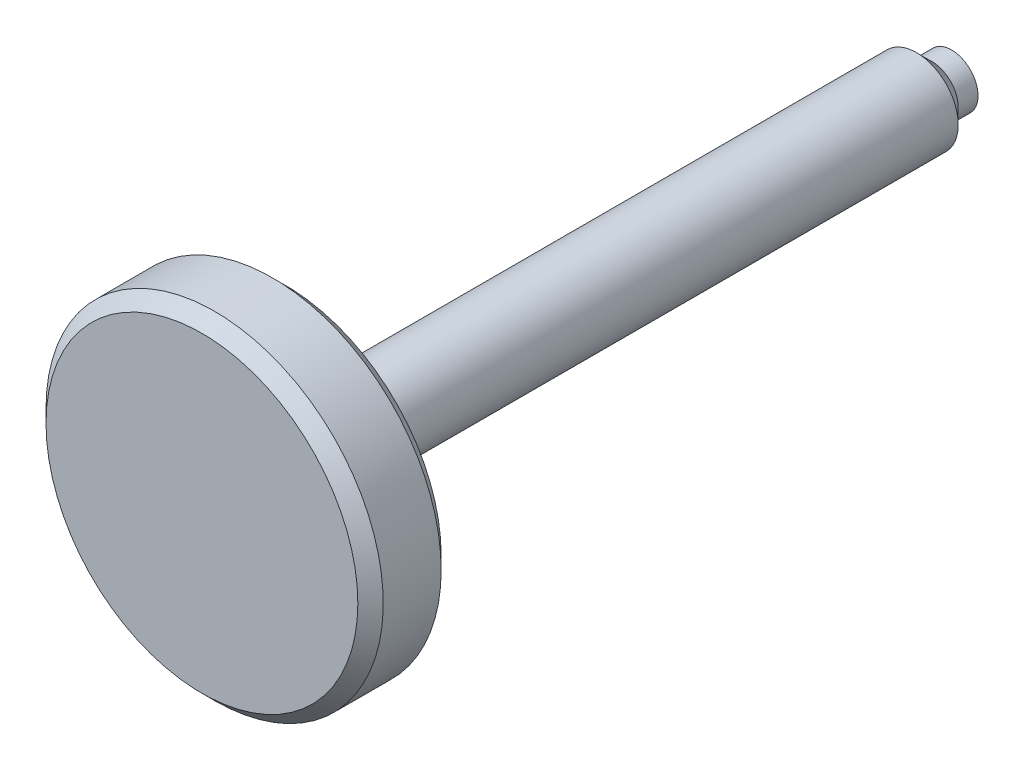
ISO-10303-21;
HEADER;
FILE_DESCRIPTION(('STEP AP214'),'2;1');
FILE_NAME('part.step','',(''),(''),'','','');
FILE_SCHEMA(('AUTOMOTIVE_DESIGN { 1 0 10303 214 1 1 1 1 }'));
ENDSEC;
DATA;
#1=APPLICATION_CONTEXT('core data for automotive mechanical design processes');
#2=APPLICATION_PROTOCOL_DEFINITION('international standard','automotive_design',2000,#1);
#3=PRODUCT_CONTEXT('',#1,'mechanical');
#4=PRODUCT('Part','Part','',(#3));
#5=PRODUCT_RELATED_PRODUCT_CATEGORY('part','',(#4));
#6=PRODUCT_DEFINITION_FORMATION('','',#4);
#7=PRODUCT_DEFINITION_CONTEXT('part definition',#1,'design');
#8=PRODUCT_DEFINITION('design','',#6,#7);
#9=PRODUCT_DEFINITION_SHAPE('','',#8);
#10=(LENGTH_UNIT() NAMED_UNIT(*) SI_UNIT(.MILLI.,.METRE.));
#11=(NAMED_UNIT(*) PLANE_ANGLE_UNIT() SI_UNIT($,.RADIAN.));
#12=(NAMED_UNIT(*) SI_UNIT($,.STERADIAN.) SOLID_ANGLE_UNIT());
#13=UNCERTAINTY_MEASURE_WITH_UNIT(LENGTH_MEASURE(1.E-05),#10,'distance_accuracy_value','');
#14=(GEOMETRIC_REPRESENTATION_CONTEXT(3) GLOBAL_UNCERTAINTY_ASSIGNED_CONTEXT((#13)) GLOBAL_UNIT_ASSIGNED_CONTEXT((#10,
#11,#12)) REPRESENTATION_CONTEXT('',''));
#15=CARTESIAN_POINT('',(0.,0.,0.));
#16=DIRECTION('',(0.,0.,1.));
#17=DIRECTION('',(1.,0.,0.));
#18=AXIS2_PLACEMENT_3D('',#15,#16,#17);
#19=CARTESIAN_POINT('',(9.4722188,-9.4722188,0.));
#20=DIRECTION('',(0.,0.,1.));
#21=DIRECTION('',(1.,0.,0.));
#22=AXIS2_PLACEMENT_3D('',#19,#20,#21);
#23=PLANE('',#22);
#24=CARTESIAN_POINT('',(0.,0.,0.));
#25=DIRECTION('',(0.,0.,1.));
#26=DIRECTION('',(1.,0.,0.));
#27=AXIS2_PLACEMENT_3D('',#24,#25,#26);
#28=CIRCLE('',#27,9.3599);
#29=CARTESIAN_POINT('',(9.3599,0.,0.));
#30=VERTEX_POINT('',#29);
#31=EDGE_CURVE('E35',#30,#30,#28,.T.);
#32=ORIENTED_EDGE('',*,*,#31,.F.);
#33=EDGE_LOOP('',(#32));
#34=FACE_BOUND('',#33,.T.);
#35=CARTESIAN_POINT('',(0.,0.,0.));
#36=DIRECTION('',(0.,0.,-1.));
#37=DIRECTION('',(-1.,0.,0.));
#38=AXIS2_PLACEMENT_3D('',#35,#36,#37);
#39=CIRCLE('',#38,2.5);
#40=CARTESIAN_POINT('',(-2.5,0.,0.));
#41=VERTEX_POINT('',#40);
#42=EDGE_CURVE('E43',#41,#41,#39,.T.);
#43=ORIENTED_EDGE('',*,*,#42,.F.);
#44=EDGE_LOOP('',(#43));
#45=FACE_BOUND('',#44,.T.);
#46=ADVANCED_FACE('F12',(#34,#45),#23,.F.);
#47=CARTESIAN_POINT('',(0.,0.,0.762));
#48=DIRECTION('',(0.,0.,1.));
#49=DIRECTION('',(1.,0.,0.));
#50=AXIS2_PLACEMENT_3D('',#47,#48,#49);
#51=CONICAL_SURFACE('',#50,10.1219,0.785398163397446);
#52=ORIENTED_EDGE('',*,*,#31,.T.);
#53=EDGE_LOOP('',(#52));
#54=FACE_BOUND('',#53,.T.);
#55=CARTESIAN_POINT('',(0.,0.,0.762));
#56=DIRECTION('',(0.,0.,-1.));
#57=DIRECTION('',(-1.,0.,0.));
#58=AXIS2_PLACEMENT_3D('',#55,#56,#57);
#59=CIRCLE('',#58,10.1219);
#60=CARTESIAN_POINT('',(-10.1219,0.,0.762));
#61=VERTEX_POINT('',#60);
#62=EDGE_CURVE('E25',#61,#61,#59,.F.);
#63=ORIENTED_EDGE('',*,*,#62,.F.);
#64=EDGE_LOOP('',(#63));
#65=FACE_BOUND('',#64,.T.);
#66=ADVANCED_FACE('F55',(#54,#65),#51,.T.);
#67=CARTESIAN_POINT('',(9.4722188,9.4722188,5.00126));
#68=DIRECTION('',(0.,0.,-1.));
#69=DIRECTION('',(-1.,0.,0.));
#70=AXIS2_PLACEMENT_3D('',#67,#68,#69);
#71=PLANE('',#70);
#72=CARTESIAN_POINT('',(0.,0.,5.00126));
#73=DIRECTION('',(0.,0.,-1.));
#74=DIRECTION('',(-1.,0.,0.));
#75=AXIS2_PLACEMENT_3D('',#72,#73,#74);
#76=CIRCLE('',#75,9.3599);
#77=CARTESIAN_POINT('',(-9.3599,0.,5.00126));
#78=VERTEX_POINT('',#77);
#79=EDGE_CURVE('E20',#78,#78,#76,.T.);
#80=ORIENTED_EDGE('',*,*,#79,.F.);
#81=EDGE_LOOP('',(#80));
#82=FACE_BOUND('',#81,.T.);
#83=ADVANCED_FACE('F57',(#82),#71,.F.);
#84=CARTESIAN_POINT('',(0.,0.,0.762));
#85=DIRECTION('',(0.,0.,-1.));
#86=DIRECTION('',(-1.,0.,0.));
#87=AXIS2_PLACEMENT_3D('',#84,#85,#86);
#88=CYLINDRICAL_SURFACE('',#87,10.1219);
#89=CARTESIAN_POINT('',(0.,0.,4.23926000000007));
#90=DIRECTION('',(0.,0.,-1.));
#91=DIRECTION('',(0.,-1.,0.));
#92=AXIS2_PLACEMENT_3D('',#89,#90,#91);
#93=CIRCLE('',#92,10.1219);
#94=CARTESIAN_POINT('',(0.,-10.1219,4.23926));
#95=VERTEX_POINT('',#94);
#96=EDGE_CURVE('E8',#95,#95,#93,.F.);
#97=ORIENTED_EDGE('',*,*,#96,.F.);
#98=EDGE_LOOP('',(#97));
#99=FACE_BOUND('',#98,.T.);
#100=ORIENTED_EDGE('',*,*,#62,.T.);
#101=EDGE_LOOP('',(#100));
#102=FACE_BOUND('',#101,.T.);
#103=ADVANCED_FACE('F53',(#99,#102),#88,.T.);
#104=CARTESIAN_POINT('',(0.,0.,4.23926));
#105=DIRECTION('',(0.,0.,-1.));
#106=DIRECTION('',(-1.,0.,0.));
#107=AXIS2_PLACEMENT_3D('',#104,#105,#106);
#108=CONICAL_SURFACE('',#107,10.1219,0.785398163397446);
#109=ORIENTED_EDGE('',*,*,#79,.T.);
#110=EDGE_LOOP('',(#109));
#111=FACE_BOUND('',#110,.T.);
#112=ORIENTED_EDGE('',*,*,#96,.T.);
#113=EDGE_LOOP('',(#112));
#114=FACE_BOUND('',#113,.T.);
#115=ADVANCED_FACE('F14',(#111,#114),#108,.T.);
#116=CARTESIAN_POINT('',(0.,0.,-39.99992));
#117=DIRECTION('',(0.,0.,1.));
#118=DIRECTION('',(1.,0.,0.));
#119=AXIS2_PLACEMENT_3D('',#116,#117,#118);
#120=CYLINDRICAL_SURFACE('',#119,2.5);
#121=CARTESIAN_POINT('',(0.,0.,-37.89616));
#122=DIRECTION('',(0.,0.,1.));
#123=DIRECTION('',(1.,0.,0.));
#124=AXIS2_PLACEMENT_3D('',#121,#122,#123);
#125=CIRCLE('',#124,2.5);
#126=CARTESIAN_POINT('',(2.5,0.,-37.89616));
#127=VERTEX_POINT('',#126);
#128=EDGE_CURVE('E16',#127,#127,#125,.T.);
#129=ORIENTED_EDGE('',*,*,#128,.T.);
#130=EDGE_LOOP('',(#129));
#131=FACE_BOUND('',#130,.T.);
#132=ORIENTED_EDGE('',*,*,#42,.T.);
#133=EDGE_LOOP('',(#132));
#134=FACE_BOUND('',#133,.T.);
#135=ADVANCED_FACE('F69',(#131,#134),#120,.T.);
#136=CARTESIAN_POINT('',(1.60655,-1.60655,-39.99992));
#137=DIRECTION('',(0.,0.,1.));
#138=DIRECTION('',(1.,0.,0.));
#139=AXIS2_PLACEMENT_3D('',#136,#137,#138);
#140=PLANE('',#139);
#141=CARTESIAN_POINT('',(0.,0.,-39.99992));
#142=DIRECTION('',(0.,0.,-1.));
#143=DIRECTION('',(-1.,0.,0.));
#144=AXIS2_PLACEMENT_3D('',#141,#142,#143);
#145=CIRCLE('',#144,1.5875);
#146=CARTESIAN_POINT('',(-1.5875,0.,-39.99992));
#147=VERTEX_POINT('',#146);
#148=EDGE_CURVE('E36',#147,#147,#145,.F.);
#149=ORIENTED_EDGE('',*,*,#148,.F.);
#150=EDGE_LOOP('',(#149));
#151=FACE_BOUND('',#150,.T.);
#152=ADVANCED_FACE('F76',(#151),#140,.F.);
#153=CARTESIAN_POINT('',(0.,0.,-39.99992));
#154=DIRECTION('',(0.,0.,-1.));
#155=DIRECTION('',(-1.,0.,0.));
#156=AXIS2_PLACEMENT_3D('',#153,#154,#155);
#157=CYLINDRICAL_SURFACE('',#156,1.5875);
#158=ORIENTED_EDGE('',*,*,#148,.T.);
#159=EDGE_LOOP('',(#158));
#160=FACE_BOUND('',#159,.T.);
#161=CARTESIAN_POINT('',(0.,0.,-38.80866));
#162=DIRECTION('',(0.,0.,1.));
#163=DIRECTION('',(1.,0.,0.));
#164=AXIS2_PLACEMENT_3D('',#161,#162,#163);
#165=CIRCLE('',#164,1.5875);
#166=CARTESIAN_POINT('',(1.5875,0.,-38.8086600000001));
#167=VERTEX_POINT('',#166);
#168=EDGE_CURVE('E33',#167,#167,#165,.T.);
#169=ORIENTED_EDGE('',*,*,#168,.F.);
#170=EDGE_LOOP('',(#169));
#171=FACE_BOUND('',#170,.T.);
#172=ADVANCED_FACE('F120',(#160,#171),#157,.T.);
#173=CARTESIAN_POINT('',(0.,0.,-37.89553));
#174=DIRECTION('',(0.,0.,1.));
#175=DIRECTION('',(1.,0.,0.));
#176=AXIS2_PLACEMENT_3D('',#173,#174,#175);
#177=CONICAL_SURFACE('',#176,2.50063,0.785398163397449);
#178=ORIENTED_EDGE('',*,*,#128,.F.);
#179=EDGE_LOOP('',(#178));
#180=FACE_BOUND('',#179,.T.);
#181=ORIENTED_EDGE('',*,*,#168,.T.);
#182=EDGE_LOOP('',(#181));
#183=FACE_BOUND('',#182,.T.);
#184=ADVANCED_FACE('F125',(#180,#183),#177,.T.);
#185=CLOSED_SHELL('',(#46,#66,#83,#103,#115,#135,#152,#172,#184));
#186=MANIFOLD_SOLID_BREP('B1',#185);
#187=ADVANCED_BREP_SHAPE_REPRESENTATION('',(#18,#186),#14);
#188=SHAPE_DEFINITION_REPRESENTATION(#9,#187);
ENDSEC;
END-ISO-10303-21;
